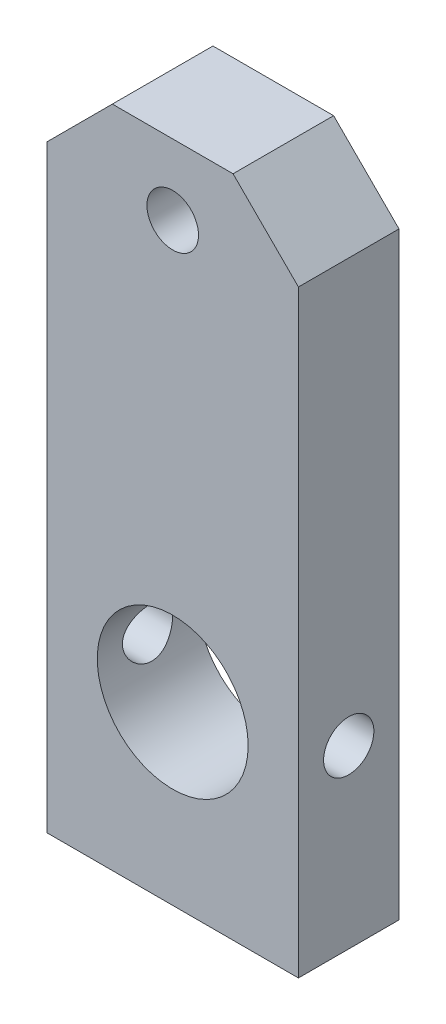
ISO-10303-21;
HEADER;
FILE_DESCRIPTION(('STEP AP214'),'2;1');
FILE_NAME('part.step','',(''),(''),'','','');
FILE_SCHEMA(('AUTOMOTIVE_DESIGN { 1 0 10303 214 1 1 1 1 }'));
ENDSEC;
DATA;
#1=APPLICATION_CONTEXT('core data for automotive mechanical design processes');
#2=APPLICATION_PROTOCOL_DEFINITION('international standard','automotive_design',2000,#1);
#3=PRODUCT_CONTEXT('',#1,'mechanical');
#4=PRODUCT('Part','Part','',(#3));
#5=PRODUCT_RELATED_PRODUCT_CATEGORY('part','',(#4));
#6=PRODUCT_DEFINITION_FORMATION('','',#4);
#7=PRODUCT_DEFINITION_CONTEXT('part definition',#1,'design');
#8=PRODUCT_DEFINITION('design','',#6,#7);
#9=PRODUCT_DEFINITION_SHAPE('','',#8);
#10=(LENGTH_UNIT() NAMED_UNIT(*) SI_UNIT(.MILLI.,.METRE.));
#11=(NAMED_UNIT(*) PLANE_ANGLE_UNIT() SI_UNIT($,.RADIAN.));
#12=(NAMED_UNIT(*) SI_UNIT($,.STERADIAN.) SOLID_ANGLE_UNIT());
#13=UNCERTAINTY_MEASURE_WITH_UNIT(LENGTH_MEASURE(1.E-05),#10,'distance_accuracy_value','');
#14=(GEOMETRIC_REPRESENTATION_CONTEXT(3) GLOBAL_UNCERTAINTY_ASSIGNED_CONTEXT((#13)) GLOBAL_UNIT_ASSIGNED_CONTEXT((#10,
#11,#12)) REPRESENTATION_CONTEXT('',''));
#15=CARTESIAN_POINT('',(0.,0.,0.));
#16=DIRECTION('',(0.,0.,1.));
#17=DIRECTION('',(1.,0.,0.));
#18=AXIS2_PLACEMENT_3D('',#15,#16,#17);
#19=CARTESIAN_POINT('',(25.,0.,10.));
#20=DIRECTION('',(0.,0.,1.));
#21=DIRECTION('',(1.,0.,0.));
#22=AXIS2_PLACEMENT_3D('',#19,#20,#21);
#23=PLANE('',#22);
#24=CARTESIAN_POINT('',(0.,35.,10.));
#25=DIRECTION('',(0.,0.,1.));
#26=DIRECTION('',(1.,0.,0.));
#27=AXIS2_PLACEMENT_3D('',#24,#25,#26);
#28=CIRCLE('',#27,15.);
#29=CARTESIAN_POINT('',(15.,35.,10.));
#30=VERTEX_POINT('',#29);
#31=EDGE_CURVE('E111',#30,#30,#28,.T.);
#32=ORIENTED_EDGE('',*,*,#31,.F.);
#33=EDGE_LOOP('',(#32));
#34=FACE_BOUND('',#33,.T.);
#35=DIRECTION('',(0.,1.,0.));
#36=VECTOR('',#35,1.);
#37=CARTESIAN_POINT('',(25.,119.,10.));
#38=LINE('',#37,#36);
#39=CARTESIAN_POINT('',(25.,0.,10.));
#40=VERTEX_POINT('',#39);
#41=CARTESIAN_POINT('',(25.,119.,10.));
#42=VERTEX_POINT('',#41);
#43=EDGE_CURVE('E125',#40,#42,#38,.T.);
#44=ORIENTED_EDGE('',*,*,#43,.T.);
#45=DIRECTION('',(-0.707106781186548,0.707106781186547,0.));
#46=VECTOR('',#45,1.);
#47=CARTESIAN_POINT('',(12.,132.,10.));
#48=LINE('',#47,#46);
#49=CARTESIAN_POINT('',(12.,132.,10.));
#50=VERTEX_POINT('',#49);
#51=EDGE_CURVE('E106',#42,#50,#48,.T.);
#52=ORIENTED_EDGE('',*,*,#51,.T.);
#53=DIRECTION('',(-1.,0.,0.));
#54=VECTOR('',#53,1.);
#55=CARTESIAN_POINT('',(-12.,132.,10.));
#56=LINE('',#55,#54);
#57=CARTESIAN_POINT('',(-12.,132.,10.));
#58=VERTEX_POINT('',#57);
#59=EDGE_CURVE('E128',#50,#58,#56,.T.);
#60=ORIENTED_EDGE('',*,*,#59,.T.);
#61=DIRECTION('',(-0.707106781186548,-0.707106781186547,0.));
#62=VECTOR('',#61,1.);
#63=CARTESIAN_POINT('',(-25.,119.,10.));
#64=LINE('',#63,#62);
#65=CARTESIAN_POINT('',(-25.,119.,10.));
#66=VERTEX_POINT('',#65);
#67=EDGE_CURVE('E130',#58,#66,#64,.T.);
#68=ORIENTED_EDGE('',*,*,#67,.T.);
#69=DIRECTION('',(0.,-1.,0.));
#70=VECTOR('',#69,1.);
#71=CARTESIAN_POINT('',(-25.,119.,10.));
#72=LINE('',#71,#70);
#73=CARTESIAN_POINT('',(-25.,0.,10.));
#74=VERTEX_POINT('',#73);
#75=EDGE_CURVE('E59',#66,#74,#72,.T.);
#76=ORIENTED_EDGE('',*,*,#75,.T.);
#77=DIRECTION('',(1.,0.,0.));
#78=VECTOR('',#77,1.);
#79=CARTESIAN_POINT('',(-25.,0.,10.));
#80=LINE('',#79,#78);
#81=EDGE_CURVE('E54',#74,#40,#80,.T.);
#82=ORIENTED_EDGE('',*,*,#81,.T.);
#83=EDGE_LOOP('',(#44,#52,#60,#68,#76,#82));
#84=FACE_BOUND('',#83,.T.);
#85=CARTESIAN_POINT('',(0.,118.,10.));
#86=DIRECTION('',(0.,0.,1.));
#87=DIRECTION('',(1.,0.,0.));
#88=AXIS2_PLACEMENT_3D('',#85,#86,#87);
#89=CIRCLE('',#88,5.125);
#90=CARTESIAN_POINT('',(5.125,118.,10.));
#91=VERTEX_POINT('',#90);
#92=EDGE_CURVE('E211',#91,#91,#89,.T.);
#93=ORIENTED_EDGE('',*,*,#92,.F.);
#94=EDGE_LOOP('',(#93));
#95=FACE_BOUND('',#94,.T.);
#96=ADVANCED_FACE('F32',(#34,#84,#95),#23,.T.);
#97=CARTESIAN_POINT('',(25.,0.,-10.));
#98=DIRECTION('',(0.,0.,1.));
#99=DIRECTION('',(1.,0.,0.));
#100=AXIS2_PLACEMENT_3D('',#97,#98,#99);
#101=PLANE('',#100);
#102=CARTESIAN_POINT('',(0.,35.,-10.));
#103=DIRECTION('',(0.,0.,1.));
#104=DIRECTION('',(1.,0.,0.));
#105=AXIS2_PLACEMENT_3D('',#102,#103,#104);
#106=CIRCLE('',#105,15.);
#107=CARTESIAN_POINT('',(15.,35.,-10.));
#108=VERTEX_POINT('',#107);
#109=EDGE_CURVE('E114',#108,#108,#106,.T.);
#110=ORIENTED_EDGE('',*,*,#109,.T.);
#111=EDGE_LOOP('',(#110));
#112=FACE_BOUND('',#111,.T.);
#113=DIRECTION('',(0.,1.,0.));
#114=VECTOR('',#113,1.);
#115=CARTESIAN_POINT('',(25.,119.,-10.));
#116=LINE('',#115,#114);
#117=CARTESIAN_POINT('',(25.,0.,-10.));
#118=VERTEX_POINT('',#117);
#119=CARTESIAN_POINT('',(25.,119.,-10.));
#120=VERTEX_POINT('',#119);
#121=EDGE_CURVE('E97',#118,#120,#116,.T.);
#122=ORIENTED_EDGE('',*,*,#121,.F.);
#123=DIRECTION('',(1.,0.,0.));
#124=VECTOR('',#123,1.);
#125=CARTESIAN_POINT('',(-25.,0.,-10.));
#126=LINE('',#125,#124);
#127=CARTESIAN_POINT('',(-25.,0.,-10.));
#128=VERTEX_POINT('',#127);
#129=EDGE_CURVE('E123',#128,#118,#126,.T.);
#130=ORIENTED_EDGE('',*,*,#129,.F.);
#131=DIRECTION('',(0.,-1.,0.));
#132=VECTOR('',#131,1.);
#133=CARTESIAN_POINT('',(-25.,119.,-10.));
#134=LINE('',#133,#132);
#135=CARTESIAN_POINT('',(-25.,119.,-10.));
#136=VERTEX_POINT('',#135);
#137=EDGE_CURVE('E121',#136,#128,#134,.T.);
#138=ORIENTED_EDGE('',*,*,#137,.F.);
#139=DIRECTION('',(-0.707106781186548,-0.707106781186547,0.));
#140=VECTOR('',#139,1.);
#141=CARTESIAN_POINT('',(-25.,119.,-10.));
#142=LINE('',#141,#140);
#143=CARTESIAN_POINT('',(-12.,132.,-10.));
#144=VERTEX_POINT('',#143);
#145=EDGE_CURVE('E119',#144,#136,#142,.T.);
#146=ORIENTED_EDGE('',*,*,#145,.F.);
#147=DIRECTION('',(-1.,0.,0.));
#148=VECTOR('',#147,1.);
#149=CARTESIAN_POINT('',(-12.,132.,-10.));
#150=LINE('',#149,#148);
#151=CARTESIAN_POINT('',(12.,132.,-10.));
#152=VERTEX_POINT('',#151);
#153=EDGE_CURVE('E99',#152,#144,#150,.T.);
#154=ORIENTED_EDGE('',*,*,#153,.F.);
#155=DIRECTION('',(-0.707106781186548,0.707106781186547,0.));
#156=VECTOR('',#155,1.);
#157=CARTESIAN_POINT('',(12.,132.,-10.));
#158=LINE('',#157,#156);
#159=EDGE_CURVE('E92',#120,#152,#158,.T.);
#160=ORIENTED_EDGE('',*,*,#159,.F.);
#161=EDGE_LOOP('',(#122,#130,#138,#146,#154,#160));
#162=FACE_BOUND('',#161,.T.);
#163=CARTESIAN_POINT('',(0.,118.,-10.));
#164=DIRECTION('',(0.,0.,1.));
#165=DIRECTION('',(1.,0.,0.));
#166=AXIS2_PLACEMENT_3D('',#163,#164,#165);
#167=CIRCLE('',#166,5.125);
#168=CARTESIAN_POINT('',(5.125,118.,-10.));
#169=VERTEX_POINT('',#168);
#170=EDGE_CURVE('E208',#169,#169,#167,.T.);
#171=ORIENTED_EDGE('',*,*,#170,.T.);
#172=EDGE_LOOP('',(#171));
#173=FACE_BOUND('',#172,.T.);
#174=ADVANCED_FACE('F93',(#112,#162,#173),#101,.F.);
#175=CARTESIAN_POINT('',(25.,119.,10.));
#176=DIRECTION('',(-1.,0.,0.));
#177=DIRECTION('',(0.,-1.,0.));
#178=AXIS2_PLACEMENT_3D('',#175,#176,#177);
#179=PLANE('',#178);
#180=CARTESIAN_POINT('',(25.,35.,0.));
#181=DIRECTION('',(1.,0.,0.));
#182=DIRECTION('',(0.,1.,0.));
#183=AXIS2_PLACEMENT_3D('',#180,#181,#182);
#184=CIRCLE('',#183,5.);
#185=CARTESIAN_POINT('',(25.,40.,0.));
#186=VERTEX_POINT('',#185);
#187=EDGE_CURVE('E202',#186,#186,#184,.T.);
#188=ORIENTED_EDGE('',*,*,#187,.F.);
#189=EDGE_LOOP('',(#188));
#190=FACE_BOUND('',#189,.T.);
#191=ORIENTED_EDGE('',*,*,#121,.T.);
#192=DIRECTION('',(0.,0.,-1.));
#193=VECTOR('',#192,1.);
#194=CARTESIAN_POINT('',(25.,119.,10.));
#195=LINE('',#194,#193);
#196=EDGE_CURVE('E11',#42,#120,#195,.T.);
#197=ORIENTED_EDGE('',*,*,#196,.F.);
#198=ORIENTED_EDGE('',*,*,#43,.F.);
#199=DIRECTION('',(0.,0.,-1.));
#200=VECTOR('',#199,1.);
#201=CARTESIAN_POINT('',(25.,0.,10.));
#202=LINE('',#201,#200);
#203=EDGE_CURVE('E110',#40,#118,#202,.T.);
#204=ORIENTED_EDGE('',*,*,#203,.T.);
#205=EDGE_LOOP('',(#191,#197,#198,#204));
#206=FACE_BOUND('',#205,.T.);
#207=ADVANCED_FACE('F34',(#190,#206),#179,.F.);
#208=CARTESIAN_POINT('',(12.,132.,10.));
#209=DIRECTION('',(-0.707106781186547,-0.707106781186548,0.));
#210=DIRECTION('',(0.707106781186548,-0.707106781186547,0.));
#211=AXIS2_PLACEMENT_3D('',#208,#209,#210);
#212=PLANE('',#211);
#213=ORIENTED_EDGE('',*,*,#159,.T.);
#214=DIRECTION('',(0.,0.,-1.));
#215=VECTOR('',#214,1.);
#216=CARTESIAN_POINT('',(12.,132.,10.));
#217=LINE('',#216,#215);
#218=EDGE_CURVE('E46',#50,#152,#217,.T.);
#219=ORIENTED_EDGE('',*,*,#218,.F.);
#220=ORIENTED_EDGE('',*,*,#51,.F.);
#221=ORIENTED_EDGE('',*,*,#196,.T.);
#222=EDGE_LOOP('',(#213,#219,#220,#221));
#223=FACE_BOUND('',#222,.T.);
#224=ADVANCED_FACE('F105',(#223),#212,.F.);
#225=CARTESIAN_POINT('',(-12.,132.,10.));
#226=DIRECTION('',(0.,-1.,0.));
#227=DIRECTION('',(0.,0.,-1.));
#228=AXIS2_PLACEMENT_3D('',#225,#226,#227);
#229=PLANE('',#228);
#230=ORIENTED_EDGE('',*,*,#153,.T.);
#231=DIRECTION('',(0.,0.,-1.));
#232=VECTOR('',#231,1.);
#233=CARTESIAN_POINT('',(-12.,132.,10.));
#234=LINE('',#233,#232);
#235=EDGE_CURVE('E141',#58,#144,#234,.T.);
#236=ORIENTED_EDGE('',*,*,#235,.F.);
#237=ORIENTED_EDGE('',*,*,#59,.F.);
#238=ORIENTED_EDGE('',*,*,#218,.T.);
#239=EDGE_LOOP('',(#230,#236,#237,#238));
#240=FACE_BOUND('',#239,.T.);
#241=ADVANCED_FACE('F189',(#240),#229,.F.);
#242=CARTESIAN_POINT('',(-25.,119.,10.));
#243=DIRECTION('',(0.707106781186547,-0.707106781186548,0.));
#244=DIRECTION('',(0.707106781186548,0.707106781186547,0.));
#245=AXIS2_PLACEMENT_3D('',#242,#243,#244);
#246=PLANE('',#245);
#247=ORIENTED_EDGE('',*,*,#145,.T.);
#248=DIRECTION('',(0.,0.,-1.));
#249=VECTOR('',#248,1.);
#250=CARTESIAN_POINT('',(-25.,119.,10.));
#251=LINE('',#250,#249);
#252=EDGE_CURVE('E138',#66,#136,#251,.T.);
#253=ORIENTED_EDGE('',*,*,#252,.F.);
#254=ORIENTED_EDGE('',*,*,#67,.F.);
#255=ORIENTED_EDGE('',*,*,#235,.T.);
#256=EDGE_LOOP('',(#247,#253,#254,#255));
#257=FACE_BOUND('',#256,.T.);
#258=ADVANCED_FACE('F185',(#257),#246,.F.);
#259=CARTESIAN_POINT('',(-25.,119.,10.));
#260=DIRECTION('',(1.,0.,0.));
#261=DIRECTION('',(0.,1.,0.));
#262=AXIS2_PLACEMENT_3D('',#259,#260,#261);
#263=PLANE('',#262);
#264=CARTESIAN_POINT('',(-25.,35.,0.));
#265=DIRECTION('',(1.,0.,0.));
#266=DIRECTION('',(0.,1.,0.));
#267=AXIS2_PLACEMENT_3D('',#264,#265,#266);
#268=CIRCLE('',#267,5.);
#269=CARTESIAN_POINT('',(-25.,40.,0.));
#270=VERTEX_POINT('',#269);
#271=EDGE_CURVE('E149',#270,#270,#268,.T.);
#272=ORIENTED_EDGE('',*,*,#271,.T.);
#273=EDGE_LOOP('',(#272));
#274=FACE_BOUND('',#273,.T.);
#275=ORIENTED_EDGE('',*,*,#137,.T.);
#276=DIRECTION('',(0.,0.,-1.));
#277=VECTOR('',#276,1.);
#278=CARTESIAN_POINT('',(-25.,0.,10.));
#279=LINE('',#278,#277);
#280=EDGE_CURVE('E135',#74,#128,#279,.T.);
#281=ORIENTED_EDGE('',*,*,#280,.F.);
#282=ORIENTED_EDGE('',*,*,#75,.F.);
#283=ORIENTED_EDGE('',*,*,#252,.T.);
#284=EDGE_LOOP('',(#275,#281,#282,#283));
#285=FACE_BOUND('',#284,.T.);
#286=ADVANCED_FACE('F181',(#274,#285),#263,.F.);
#287=CARTESIAN_POINT('',(-25.,0.,10.));
#288=DIRECTION('',(0.,1.,0.));
#289=DIRECTION('',(-1.,0.,0.));
#290=AXIS2_PLACEMENT_3D('',#287,#288,#289);
#291=PLANE('',#290);
#292=ORIENTED_EDGE('',*,*,#129,.T.);
#293=ORIENTED_EDGE('',*,*,#203,.F.);
#294=ORIENTED_EDGE('',*,*,#81,.F.);
#295=ORIENTED_EDGE('',*,*,#280,.T.);
#296=EDGE_LOOP('',(#292,#293,#294,#295));
#297=FACE_BOUND('',#296,.T.);
#298=ADVANCED_FACE('F166',(#297),#291,.F.);
#299=CARTESIAN_POINT('',(0.,35.,10.));
#300=DIRECTION('',(0.,0.,-1.));
#301=DIRECTION('',(-1.,0.,0.));
#302=AXIS2_PLACEMENT_3D('',#299,#300,#301);
#303=CYLINDRICAL_SURFACE('',#302,15.);
#304=CARTESIAN_POINT('',(-15.,35.,5.));
#305=CARTESIAN_POINT('',(-15.0000007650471,34.7271831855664,5.00000126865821));
#306=CARTESIAN_POINT('',(-14.9924884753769,34.4543740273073,4.97759866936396));
#307=CARTESIAN_POINT('',(-14.9632605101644,33.9167911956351,4.88885445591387));
#308=CARTESIAN_POINT('',(-14.941543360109,33.6520183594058,4.82250828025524));
#309=CARTESIAN_POINT('',(-14.8862653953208,33.1383360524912,4.64840378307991));
#310=CARTESIAN_POINT('',(-14.8527243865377,32.8894008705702,4.54071468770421));
#311=CARTESIAN_POINT('',(-14.7772222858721,32.413125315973,4.28729413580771));
#312=CARTESIAN_POINT('',(-14.7352595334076,32.1857892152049,4.1415551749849));
#313=CARTESIAN_POINT('',(-14.6457047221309,31.7512916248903,3.8108709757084));
#314=CARTESIAN_POINT('',(-14.5979778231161,31.5449814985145,3.62484382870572));
#315=CARTESIAN_POINT('',(-14.5030157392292,31.1658365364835,3.22116422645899));
#316=CARTESIAN_POINT('',(-14.4557806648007,30.9930090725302,3.00350482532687));
#317=CARTESIAN_POINT('',(-14.3656666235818,30.680875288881,2.53507442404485));
#318=CARTESIAN_POINT('',(-14.3229519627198,30.5426757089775,2.28353130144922));
#319=CARTESIAN_POINT('',(-14.2487652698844,30.3109056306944,1.75911952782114));
#320=CARTESIAN_POINT('',(-14.2172898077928,30.2173215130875,1.48625741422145));
#321=CARTESIAN_POINT('',(-14.1705651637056,30.0806326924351,0.936633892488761));
#322=CARTESIAN_POINT('',(-14.1548047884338,30.0359327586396,0.660313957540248));
#323=CARTESIAN_POINT('',(-14.1397828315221,29.9932943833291,0.103681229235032));
#324=CARTESIAN_POINT('',(-14.1405161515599,29.9953414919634,-0.176630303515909));
#325=CARTESIAN_POINT('',(-14.1579507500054,30.0449004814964,-0.719683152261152));
#326=CARTESIAN_POINT('',(-14.1739207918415,30.0903304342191,-0.982642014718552));
#327=CARTESIAN_POINT('',(-14.2188328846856,30.2219691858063,-1.49696709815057));
#328=CARTESIAN_POINT('',(-14.2477764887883,30.3081828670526,-1.74833192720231));
#329=CARTESIAN_POINT('',(-14.3158955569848,30.5203047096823,-2.23706374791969));
#330=CARTESIAN_POINT('',(-14.3552282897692,30.6468297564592,-2.47414012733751));
#331=CARTESIAN_POINT('',(-14.4396279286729,30.9355544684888,-2.92435454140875));
#332=CARTESIAN_POINT('',(-14.4846964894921,31.0977644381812,-3.13748563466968));
#333=CARTESIAN_POINT('',(-14.5783664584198,31.4632533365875,-3.54545799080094));
#334=CARTESIAN_POINT('',(-14.6270294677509,31.6682342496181,-3.73876347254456));
#335=CARTESIAN_POINT('',(-14.7203469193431,32.10830215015,-4.08865633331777));
#336=CARTESIAN_POINT('',(-14.765000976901,32.343392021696,-4.24524019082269));
#337=CARTESIAN_POINT('',(-14.8458553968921,32.8402619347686,-4.51848150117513));
#338=CARTESIAN_POINT('',(-14.8819675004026,33.1022836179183,-4.6347274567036));
#339=CARTESIAN_POINT('',(-14.9410283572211,33.6436545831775,-4.82101586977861));
#340=CARTESIAN_POINT('',(-14.9639816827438,33.9229978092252,-4.8910743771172));
#341=CARTESIAN_POINT('',(-14.9933813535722,34.4780808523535,-4.98027833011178));
#342=CARTESIAN_POINT('',(-15.0005000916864,34.7534520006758,-5.00149904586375));
#343=CARTESIAN_POINT('',(-14.9994451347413,35.3038753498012,-4.99833663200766));
#344=CARTESIAN_POINT('',(-14.9912740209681,35.5789275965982,-4.97396120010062));
#345=CARTESIAN_POINT('',(-14.9610012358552,36.1125993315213,-4.8819404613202));
#346=CARTESIAN_POINT('',(-14.9393099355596,36.3714640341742,-4.81556896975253));
#347=CARTESIAN_POINT('',(-14.8845923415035,36.8742797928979,-4.64303277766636));
#348=CARTESIAN_POINT('',(-14.8515646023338,37.118228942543,-4.53686300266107));
#349=CARTESIAN_POINT('',(-14.7764465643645,37.5914414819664,-4.28464784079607));
#350=CARTESIAN_POINT('',(-14.7341407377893,37.8201497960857,-4.13762703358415));
#351=CARTESIAN_POINT('',(-14.6452626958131,38.2503241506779,-3.80902924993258));
#352=CARTESIAN_POINT('',(-14.5986891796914,38.4517818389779,-3.62744171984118));
#353=CARTESIAN_POINT('',(-14.5038423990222,38.8312625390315,-3.22510624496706));
#354=CARTESIAN_POINT('',(-14.4555880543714,39.0078048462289,-3.0029538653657));
#355=CARTESIAN_POINT('',(-14.3649986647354,39.3212876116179,-2.53114216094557));
#356=CARTESIAN_POINT('',(-14.3226636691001,39.4582277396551,-2.28148260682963));
#357=CARTESIAN_POINT('',(-14.2491195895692,39.6879846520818,-1.76163492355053));
#358=CARTESIAN_POINT('',(-14.2178880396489,39.7808906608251,-1.49148960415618));
#359=CARTESIAN_POINT('',(-14.1705416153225,39.9194733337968,-0.938106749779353));
#360=CARTESIAN_POINT('',(-14.154419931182,39.9651712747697,-0.654875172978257));
#361=CARTESIAN_POINT('',(-14.1398929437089,40.0063814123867,-0.0990145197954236));
#362=CARTESIAN_POINT('',(-14.1406200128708,40.004351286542,0.17341170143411));
#363=CARTESIAN_POINT('',(-14.1575634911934,39.9562114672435,0.713825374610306));
#364=CARTESIAN_POINT('',(-14.1737789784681,39.9101043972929,0.981813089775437));
#365=CARTESIAN_POINT('',(-14.2192262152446,39.7768590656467,1.50067831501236));
#366=CARTESIAN_POINT('',(-14.2482049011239,39.6905167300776,1.75178412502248));
#367=CARTESIAN_POINT('',(-14.3158199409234,39.4798968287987,2.23613703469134));
#368=CARTESIAN_POINT('',(-14.3544584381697,39.355610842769,2.46938015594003));
#369=CARTESIAN_POINT('',(-14.4391414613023,39.0663034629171,2.92241834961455));
#370=CARTESIAN_POINT('',(-14.4854355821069,38.8997412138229,3.14118250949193));
#371=CARTESIAN_POINT('',(-14.5791678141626,38.5332144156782,3.548449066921));
#372=CARTESIAN_POINT('',(-14.6266062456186,38.3332404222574,3.73694287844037));
#373=CARTESIAN_POINT('',(-14.7195015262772,37.8962077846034,4.08572206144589));
#374=CARTESIAN_POINT('',(-14.7648090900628,37.6580075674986,4.244621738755));
#375=CARTESIAN_POINT('',(-14.8462995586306,37.1567867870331,4.51995214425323));
#376=CARTESIAN_POINT('',(-14.8824847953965,36.8937725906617,4.63639372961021));
#377=CARTESIAN_POINT('',(-14.9402757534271,36.3624682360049,4.81860816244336));
#378=CARTESIAN_POINT('',(-14.9624606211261,36.0949387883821,4.88641233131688));
#379=CARTESIAN_POINT('',(-14.9923203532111,35.5516020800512,4.97710140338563));
#380=CARTESIAN_POINT('',(-14.9999992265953,35.2757971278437,4.99999871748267));
#381=CARTESIAN_POINT('',(-15.,35.,5.));
#382=B_SPLINE_CURVE_WITH_KNOTS('',3,(#304,#305,#306,#307,#308,#309,#310,#311,#312,#313,#314,
#315,#316,#317,#318,#319,#320,#321,#322,#323,#324,#325,#326,#327,#328,#329,#330,#331,#332,#333,
#334,#335,#336,#337,#338,#339,#340,#341,#342,#343,#344,#345,#346,#347,#348,#349,#350,#351,#352,
#353,#354,#355,#356,#357,#358,#359,#360,#361,#362,#363,#364,#365,#366,#367,#368,#369,#370,#371,
#372,#373,#374,#375,#376,#377,#378,#379,#380,#381),.UNSPECIFIED.,.T.,.F.,(4,2,2,2,2,2,2,2,2,2,2,
2,2,2,2,2,2,2,2,2,2,2,2,2,2,2,2,2,2,2,2,2,2,2,2,2,2,2,4),(0.,0.817435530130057,1.6349559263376,
2.45111336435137,3.2674318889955,4.1092342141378,4.95122166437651,5.81741924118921,
6.6833522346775,7.52009628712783,8.3565816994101,9.15484132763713,9.9531965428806,
10.764408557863,11.5758551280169,12.4296652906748,13.2835572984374,14.1459202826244,
15.0079834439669,15.832679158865,16.6572356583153,17.4579078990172,18.2586822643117,
19.0805199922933,19.9026090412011,20.7620511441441,21.6215004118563,22.479200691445,
23.3365142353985,24.1497833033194,24.9630039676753,25.7607793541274,26.5587319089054,
27.3915033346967,28.2245105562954,29.0899830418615,29.9552340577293,30.7818279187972,
31.6081933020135),.UNSPECIFIED.);
#383=CARTESIAN_POINT('',(-15.,35.,5.));
#384=VERTEX_POINT('',#383);
#385=EDGE_CURVE('E36',#384,#384,#382,.T.);
#386=ORIENTED_EDGE('',*,*,#385,.F.);
#387=EDGE_LOOP('',(#386));
#388=FACE_BOUND('',#387,.T.);
#389=CARTESIAN_POINT('',(14.142135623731,40.,0.));
#390=CARTESIAN_POINT('',(14.1421347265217,40.0000012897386,-0.27234087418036));
#391=CARTESIAN_POINT('',(14.1500884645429,39.9776739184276,-0.544673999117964));
#392=CARTESIAN_POINT('',(14.1808787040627,39.8892556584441,-1.08127210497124));
#393=CARTESIAN_POINT('',(14.2037176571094,39.823157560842,-1.34553574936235));
#394=CARTESIAN_POINT('',(14.2614101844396,39.6497774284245,-1.85813446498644));
#395=CARTESIAN_POINT('',(14.2962401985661,39.5425761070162,-2.10649964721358));
#396=CARTESIAN_POINT('',(14.3739561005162,39.2903081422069,-2.58180024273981));
#397=CARTESIAN_POINT('',(14.4168437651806,39.1452331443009,-2.80873091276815));
#398=CARTESIAN_POINT('',(14.5077244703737,38.8152557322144,-3.24359981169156));
#399=CARTESIAN_POINT('',(14.5558447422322,38.6291217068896,-3.45057714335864));
#400=CARTESIAN_POINT('',(14.6506932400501,38.224938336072,-3.83103400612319));
#401=CARTESIAN_POINT('',(14.6974212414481,38.0068838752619,-4.00450815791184));
#402=CARTESIAN_POINT('',(14.7856933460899,37.5380225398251,-4.31739448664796));
#403=CARTESIAN_POINT('',(14.8270703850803,37.2865095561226,-4.45579985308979));
#404=CARTESIAN_POINT('',(14.8984793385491,36.7621561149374,-4.68795792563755));
#405=CARTESIAN_POINT('',(14.9285143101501,36.4893214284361,-4.78172266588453));
#406=CARTESIAN_POINT('',(14.9729537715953,35.9401440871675,-4.91867927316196));
#407=CARTESIAN_POINT('',(14.987865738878,35.6642537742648,-4.96351723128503));
#408=CARTESIAN_POINT('',(15.0021804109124,35.1084893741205,-5.0065814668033));
#409=CARTESIAN_POINT('',(15.0015871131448,34.8286163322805,-5.00481975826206));
#410=CARTESIAN_POINT('',(14.9853019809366,34.2844824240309,-4.95577872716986));
#411=CARTESIAN_POINT('',(14.9702032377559,34.0200397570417,-4.91028735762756));
#412=CARTESIAN_POINT('',(14.9273483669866,33.5027828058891,-4.77803509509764));
#413=CARTESIAN_POINT('',(14.8995913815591,33.2499693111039,-4.69127140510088));
#414=CARTESIAN_POINT('',(14.8337835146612,32.7592376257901,-4.47789341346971));
#415=CARTESIAN_POINT('',(14.7956021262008,32.5215588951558,-4.35077030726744));
#416=CARTESIAN_POINT('',(14.712919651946,32.0703783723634,-4.06070147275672));
#417=CARTESIAN_POINT('',(14.6684168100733,31.8568833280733,-3.89774578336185));
#418=CARTESIAN_POINT('',(14.5753095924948,31.4494956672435,-3.5316280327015));
#419=CARTESIAN_POINT('',(14.5266107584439,31.2569992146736,-3.32693421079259));
#420=CARTESIAN_POINT('',(14.432366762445,30.9086137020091,-2.8877563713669));
#421=CARTESIAN_POINT('',(14.3868220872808,30.7527302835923,-2.65326777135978));
#422=CARTESIAN_POINT('',(14.3035262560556,30.4800627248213,-2.1567318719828));
#423=CARTESIAN_POINT('',(14.2658954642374,30.3638676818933,-1.89433934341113));
#424=CARTESIAN_POINT('',(14.2040825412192,30.1777840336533,-1.35214302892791));
#425=CARTESIAN_POINT('',(14.1798947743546,30.1078760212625,-1.07234659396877));
#426=CARTESIAN_POINT('',(14.1489818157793,30.0191935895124,-0.516808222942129));
#427=CARTESIAN_POINT('',(14.1415180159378,29.9982545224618,-0.24145287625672));
#428=CARTESIAN_POINT('',(14.1428336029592,30.0019728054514,0.308880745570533));
#429=CARTESIAN_POINT('',(14.1516100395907,30.0266218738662,0.583859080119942));
#430=CARTESIAN_POINT('',(14.183680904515,30.1188717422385,1.11578482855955));
#431=CARTESIAN_POINT('',(14.206466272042,30.1849680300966,1.3730271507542));
#432=CARTESIAN_POINT('',(14.2634276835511,30.3564306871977,1.87271803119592));
#433=CARTESIAN_POINT('',(14.297605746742,30.4618040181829,2.1151639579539));
#434=CARTESIAN_POINT('',(14.3748438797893,30.7126282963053,2.58690210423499));
#435=CARTESIAN_POINT('',(14.4181512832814,30.8592444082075,2.81553321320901));
#436=CARTESIAN_POINT('',(14.5082884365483,31.1870718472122,3.24573026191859));
#437=CARTESIAN_POINT('',(14.5551192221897,31.3682933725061,3.44728819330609));
#438=CARTESIAN_POINT('',(14.6497519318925,31.7705414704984,3.82763992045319));
#439=CARTESIAN_POINT('',(14.6974921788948,31.9930636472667,4.00487195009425));
#440=CARTESIAN_POINT('',(14.7863425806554,32.4658635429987,4.31958071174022));
#441=CARTESIAN_POINT('',(14.8274529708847,32.7161402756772,4.45705885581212));
#442=CARTESIAN_POINT('',(14.8982202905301,33.2361006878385,4.68710052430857));
#443=CARTESIAN_POINT('',(14.9279515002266,33.505644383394,4.77995638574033));
#444=CARTESIAN_POINT('',(14.9729305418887,34.0577076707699,4.91863871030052));
#445=CARTESIAN_POINT('',(14.9881836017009,34.3402225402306,4.96448214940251));
#446=CARTESIAN_POINT('',(15.0020931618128,34.8959233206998,5.00631038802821));
#447=CARTESIAN_POINT('',(15.001496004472,35.1689236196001,5.00453726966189));
#448=CARTESIAN_POINT('',(14.9856098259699,35.7105557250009,4.95671345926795));
#449=CARTESIAN_POINT('',(14.9703219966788,35.9791878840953,4.91066635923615));
#450=CARTESIAN_POINT('',(14.9270457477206,36.5002105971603,4.77708882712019));
#451=CARTESIAN_POINT('',(14.8992629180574,36.752791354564,4.69022892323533));
#452=CARTESIAN_POINT('',(14.8338580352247,37.239891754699,4.47811234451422));
#453=CARTESIAN_POINT('',(14.7962342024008,37.4744081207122,4.35284872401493));
#454=CARTESIAN_POINT('',(14.713293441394,37.9281700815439,4.06215243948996));
#455=CARTESIAN_POINT('',(14.6677436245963,38.1465312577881,3.89540657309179));
#456=CARTESIAN_POINT('',(14.574649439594,38.5529051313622,3.52871304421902));
#457=CARTESIAN_POINT('',(14.5271044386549,38.740908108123,3.32875478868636));
#458=CARTESIAN_POINT('',(14.4331639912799,39.0887090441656,2.89195322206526));
#459=CARTESIAN_POINT('',(14.3868863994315,39.2471148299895,2.6539724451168));
#460=CARTESIAN_POINT('',(14.3030096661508,39.5215717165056,2.1533278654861));
#461=CARTESIAN_POINT('',(14.2654082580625,39.6376338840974,1.89067053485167));
#462=CARTESIAN_POINT('',(14.2050667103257,39.8192191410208,1.36019087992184));
#463=CARTESIAN_POINT('',(14.1817316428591,39.8867895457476,1.09313868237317));
#464=CARTESIAN_POINT('',(14.1502691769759,39.9771716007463,0.550719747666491));
#465=CARTESIAN_POINT('',(14.1421365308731,39.999998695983,0.275355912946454));
#466=CARTESIAN_POINT('',(14.142135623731,40.,0.));
#467=B_SPLINE_CURVE_WITH_KNOTS('',3,(#389,#390,#391,#392,#393,#394,#395,#396,#397,#398,#399,
#400,#401,#402,#403,#404,#405,#406,#407,#408,#409,#410,#411,#412,#413,#414,#415,#416,#417,#418,
#419,#420,#421,#422,#423,#424,#425,#426,#427,#428,#429,#430,#431,#432,#433,#434,#435,#436,#437,
#438,#439,#440,#441,#442,#443,#444,#445,#446,#447,#448,#449,#450,#451,#452,#453,#454,#455,#456,
#457,#458,#459,#460,#461,#462,#463,#464,#465,#466),.UNSPECIFIED.,.T.,.F.,(4,2,2,2,2,2,2,2,2,2,2,
2,2,2,2,2,2,2,2,2,2,2,2,2,2,2,2,2,2,2,2,2,2,2,2,2,2,2,4),(0.,0.816002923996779,1.63214027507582,
2.44668313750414,3.26140583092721,4.1050668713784,4.94886325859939,5.81467530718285,
6.68025381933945,7.51571593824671,8.35096266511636,9.15345024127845,9.95599220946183,
10.7690827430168,11.5823995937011,12.4340087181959,13.2857489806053,14.1496319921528,
15.0131525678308,15.837714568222,16.6621267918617,17.4582197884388,18.2544539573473,
19.0759428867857,19.8976742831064,20.7589404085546,21.6201759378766,22.4756895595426,
23.3308941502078,24.1459042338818,24.9608482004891,25.7628478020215,26.5649925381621,
27.3967759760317,28.2288252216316,29.0934451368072,29.9578389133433,30.7831606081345,
31.6081973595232),.UNSPECIFIED.);
#468=CARTESIAN_POINT('',(14.142135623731,40.,0.));
#469=VERTEX_POINT('',#468);
#470=EDGE_CURVE('E144',#469,#469,#467,.T.);
#471=ORIENTED_EDGE('',*,*,#470,.F.);
#472=EDGE_LOOP('',(#471));
#473=FACE_BOUND('',#472,.T.);
#474=ORIENTED_EDGE('',*,*,#31,.T.);
#475=EDGE_LOOP('',(#474));
#476=FACE_BOUND('',#475,.T.);
#477=ORIENTED_EDGE('',*,*,#109,.F.);
#478=EDGE_LOOP('',(#477));
#479=FACE_BOUND('',#478,.T.);
#480=ADVANCED_FACE('F150',(#388,#473,#476,#479),#303,.F.);
#481=CARTESIAN_POINT('',(0.,118.,10.));
#482=DIRECTION('',(0.,0.,-1.));
#483=DIRECTION('',(-1.,0.,0.));
#484=AXIS2_PLACEMENT_3D('',#481,#482,#483);
#485=CYLINDRICAL_SURFACE('',#484,5.125);
#486=ORIENTED_EDGE('',*,*,#92,.T.);
#487=EDGE_LOOP('',(#486));
#488=FACE_BOUND('',#487,.T.);
#489=ORIENTED_EDGE('',*,*,#170,.F.);
#490=EDGE_LOOP('',(#489));
#491=FACE_BOUND('',#490,.T.);
#492=ADVANCED_FACE('F158',(#488,#491),#485,.F.);
#493=CARTESIAN_POINT('',(-25.,35.,0.));
#494=DIRECTION('',(1.,0.,0.));
#495=DIRECTION('',(0.,1.,0.));
#496=AXIS2_PLACEMENT_3D('',#493,#494,#495);
#497=CYLINDRICAL_SURFACE('',#496,5.);
#498=ORIENTED_EDGE('',*,*,#470,.T.);
#499=EDGE_LOOP('',(#498));
#500=FACE_BOUND('',#499,.T.);
#501=ORIENTED_EDGE('',*,*,#187,.T.);
#502=EDGE_LOOP('',(#501));
#503=FACE_BOUND('',#502,.T.);
#504=ADVANCED_FACE('F154',(#500,#503),#497,.F.);
#505=ORIENTED_EDGE('',*,*,#385,.T.);
#506=EDGE_LOOP('',(#505));
#507=FACE_BOUND('',#506,.T.);
#508=ORIENTED_EDGE('',*,*,#271,.F.);
#509=EDGE_LOOP('',(#508));
#510=FACE_BOUND('',#509,.T.);
#511=ADVANCED_FACE('F157',(#507,#510),#497,.F.);
#512=CLOSED_SHELL('',(#96,#174,#207,#224,#241,#258,#286,#298,#480,#492,#504,#511));
#513=MANIFOLD_SOLID_BREP('B2',#512);
#514=ADVANCED_BREP_SHAPE_REPRESENTATION('',(#18,#513),#14);
#515=SHAPE_DEFINITION_REPRESENTATION(#9,#514);
ENDSEC;
END-ISO-10303-21;
